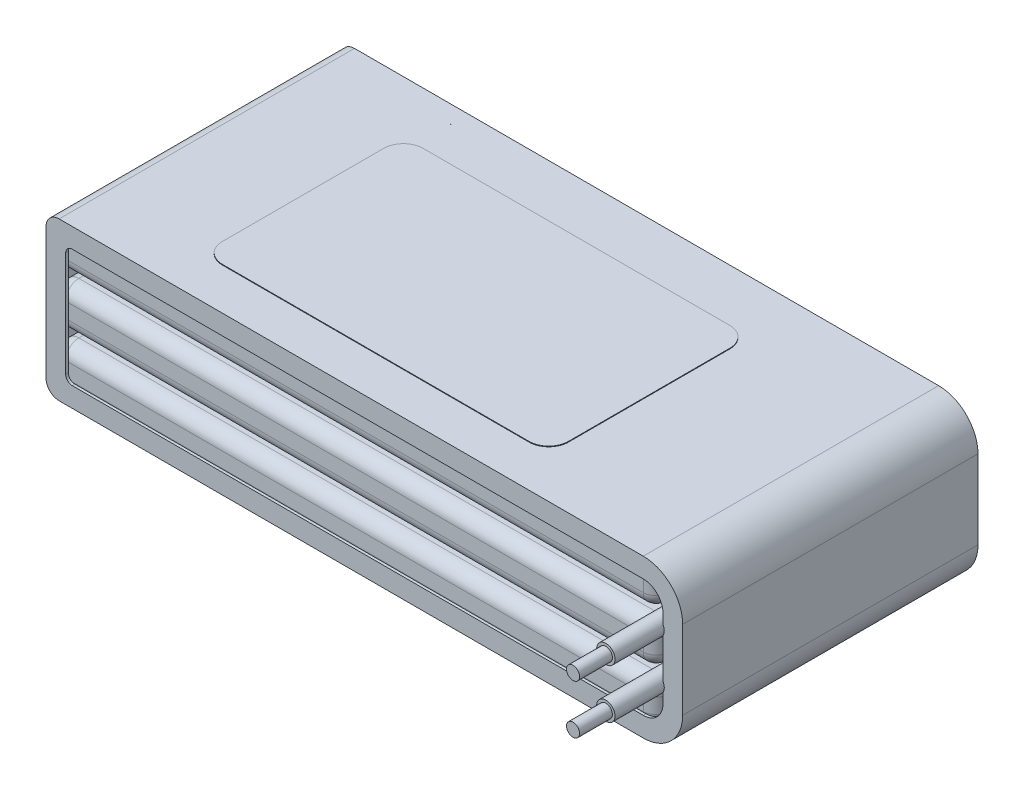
from build123d import *

# Parameters (mm, degrees)
SKETCH1_W             = 92
SKETCH1_H             = 44
BOSS_EXTRUDE1_DEPTH   = 3.15
FILLET1_R             = 2
LPATTERN2_COUNT       = 3
LPATTERN2_PITCH       = 7.85
BOSS_EXTRUDE2_DEPTH   = 22.5
BOSS_EXTRUDE5_DEPTH   = 0.4
BOSS_EXTRUDE7_DEPTH   = 0.4
FILLET2_R             = 1
SKETCH4_R             = 1.4
BOSS_EXTRUDE8_DEPTH   = 30
BOSS_EXTRUDE8_2_DEPTH = 30
SKETCH5_R             = 1
BOSS_EXTRUDE4_DEPTH   = 5
BOSS_EXTRUDE4_2_DEPTH = 5
BOSS_EXTRUDE9_DEPTH   = 0.1


with BuildPart() as part:
    # Sketch1 → Boss-Extrude1 (new, symmetric)
    with BuildSketch(Plane(origin=(0, 0, 0), x_dir=(1, 0, 0), z_dir=(0, 1, 0))):
        Rectangle(SKETCH1_W, SKETCH1_H)
    extrude(amount=BOSS_EXTRUDE1_DEPTH, both=True)

    # Fillet1
    fillet1_edges = [part.edges().sort_by_distance(p)[0] for p in [
        (46, 3.15, 0),
        (0, 3.15, -22),
        (-46, 3.15, 0),
        (0, -3.15, -22),
        (46, -3.15, 0),
        (0, -3.15, 22),
        (-46, -3.15, 0),
        (0, 3.15, 22),
        (-46, 0, -22),
        (46, 0, -22),
        (46, 0, 22),
        (-46, 0, 22),
    ]]
    fillet(fillet1_edges, radius=FILLET1_R)


with BuildPart() as lpattern2_1:
    # LPattern2: pattern copy
    add(part.part.moved(Location(Vector(0, -1, 0) * (1 * LPATTERN2_PITCH))))


with BuildPart() as lpattern2_2:
    # LPattern2: pattern copy
    add(part.part.moved(Location(Vector(0, -1, 0) * (2 * LPATTERN2_PITCH))))


with BuildPart() as body_4:
    # Sketch3 → Boss-Extrude2 (new, symmetric)
    with BuildSketch(Plane.XY):
        with BuildLine():
            Line((-46.5, 2.15), (-46.5, -17.85))
            ThreePointArc((-46.5, -17.85), (-45.914213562, -19.264213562), (-44.5, -19.85))
            Line((-44.5, -19.85), (44.5, -19.85))
            ThreePointArc((44.5, -19.85), (48.742640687, -18.092640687), (50.5, -13.85))
            Line((50.5, -13.85), (50.5, -1.85))
            ThreePointArc((50.5, -1.85), (48.742640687, 2.392640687), (44.5, 4.15))
            Line((44.5, 4.15), (-44.5, 4.15))
            ThreePointArc((-44.5, 4.15), (-45.914213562, 3.564213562), (-46.5, 2.15))
        make_face()
        with BuildLine():
            Line((-44.5, 3.65), (44.5, 3.65))
            ThreePointArc((44.5, 3.65), (48.389087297, 2.039087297), (50, -1.85))
            Line((50, -1.85), (50, -13.85))
            ThreePointArc((50, -13.85), (48.389087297, -17.739087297), (44.5, -19.35))
            Line((44.5, -19.35), (-44.5, -19.35))
            ThreePointArc((-44.5, -19.35), (-45.560660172, -18.910660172), (-46, -17.85))
            Line((-46, -17.85), (-46, 2.15))
            ThreePointArc((-46, 2.15), (-45.560660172, 3.210660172), (-44.5, 3.65))
        make_face(mode=Mode.SUBTRACT)
    extrude(amount=BOSS_EXTRUDE2_DEPTH, both=True)

    # Sketch6 → Boss-Extrude5 (add)
    with BuildSketch(Plane(origin=(0, 0, -22.5), x_dir=(-1, 0, 0), z_dir=(0, 0, -1))):
        with BuildLine():
            Line((-44.5, 4.15), (44.5, 4.15))
            ThreePointArc((44.5, 4.15), (45.914213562, 3.564213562), (46.5, 2.15))
            Line((46.5, 2.15), (46.5, -17.85))
            ThreePointArc((46.5, -17.85), (45.914213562, -19.264213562), (44.5, -19.85))
            Line((44.5, -19.85), (-44.5, -19.85))
            ThreePointArc((-44.5, -19.85), (-48.742640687, -18.092640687), (-50.5, -13.85))
            Line((-50.5, -13.85), (-50.5, -1.85))
            ThreePointArc((-50.5, -1.85), (-48.742640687, 2.392640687), (-44.5, 4.15))
        make_face()
        with BuildLine():
            Line((43.5, -16.85), (-44.5, -16.85))
            ThreePointArc((-44.5, -16.85), (-46.621320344, -15.971320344), (-47.5, -13.85))
            Line((-47.5, -13.85), (-47.5, -1.85))
            ThreePointArc((-47.5, -1.85), (-46.621320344, 0.271320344), (-44.5, 1.15))
            Line((-44.5, 1.15), (43.5, 1.15))
            Line((43.5, 1.15), (43.5, -16.85))
        make_face(mode=Mode.SUBTRACT)
    extrude(amount=-BOSS_EXTRUDE5_DEPTH)

    # Sketch7 → Boss-Extrude7 (add)
    with BuildSketch(Plane.XY.offset(22.5)):
        with BuildLine():
            Line((44.5, 4.15), (-44.5, 4.15))
            ThreePointArc((-44.5, 4.15), (-45.914213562, 3.564213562), (-46.5, 2.15))
            Line((-46.5, 2.15), (-46.5, -17.85))
            ThreePointArc((-46.5, -17.85), (-45.914213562, -19.264213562), (-44.5, -19.85))
            Line((-44.5, -19.85), (44.5, -19.85))
            ThreePointArc((44.5, -19.85), (48.742640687, -18.092640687), (50.5, -13.85))
            Line((50.5, -13.85), (50.5, -1.85))
            ThreePointArc((50.5, -1.85), (48.742640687, 2.392640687), (44.5, 4.15))
        make_face()
        with BuildLine():
            Line((44.5, 1.15), (-43.5, 1.15))
            Line((-43.5, 1.15), (-43.5, -16.85))
            Line((-43.5, -16.85), (44.5, -16.85))
            ThreePointArc((44.5, -16.85), (46.621320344, -15.971320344), (47.5, -13.85))
            Line((47.5, -13.85), (47.5, -1.85))
            ThreePointArc((47.5, -1.85), (46.621320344, 0.271320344), (44.5, 1.15))
        make_face(mode=Mode.SUBTRACT)
    extrude(amount=-BOSS_EXTRUDE7_DEPTH)

    # Fillet2
    fillet2_edges = [body_4.edges().sort_by_distance(p)[0] for p in [
        (-43.5, -16.85, 22.3),
        (-43.5, 1.15, 22.3),
        (-43.5, -16.85, -22.3),
        (-43.5, 1.15, -22.3),
    ]]
    fillet(fillet2_edges, radius=FILLET2_R)


with BuildPart() as body_5:
    # Sketch4 → Boss-Extrude8 (new body)
    with BuildSketch(Plane.XY):
        with Locations((46.3, -4.1)):
            Circle(SKETCH4_R)
    extrude(amount=BOSS_EXTRUDE8_DEPTH)


with BuildPart() as body_6:
    # Sketch4 → Boss-Extrude8 2 (new body)
    with BuildSketch(Plane.XY):
        with Locations(Location((46.3, -11.6, 0), (0, 0, 180))):
            Circle(SKETCH4_R)
    extrude(amount=BOSS_EXTRUDE8_2_DEPTH)


with BuildPart() as body_7:
    # Sketch5 → Boss-Extrude4 (new body)
    with BuildSketch(Plane.XY.offset(30)):
        with Locations((46.3, -4.1)):
            Circle(SKETCH5_R)
    extrude(amount=BOSS_EXTRUDE4_DEPTH)


with BuildPart() as body_8:
    # Sketch5 → Boss-Extrude4 2 (new body)
    with BuildSketch(Plane.XY.offset(30)):
        with Locations((46.3, -11.6)):
            Circle(SKETCH5_R)
    extrude(amount=BOSS_EXTRUDE4_2_DEPTH)


with BuildPart() as body_9:
    # Sketch8 → Boss-Extrude9 (new body)
    with BuildSketch(Plane(origin=(0, 4.15, 0), x_dir=(1, 0, 0), z_dir=(0, 1, 0))):
        with BuildLine():
            Line((-25.982985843, 14.437699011), (20.756077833, 14.437699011))
            ThreePointArc((20.756077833, 14.437699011), (22.877398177, 13.559019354), (23.756077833, 11.437699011))
            Line((23.756077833, 11.437699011), (23.756077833, -13.156785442))
            ThreePointArc((23.756077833, -13.156785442), (22.877398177, -15.278105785), (20.756077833, -16.156785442))
            Line((20.756077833, -16.156785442), (-25.982985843, -16.156785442))
            ThreePointArc((-25.982985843, -16.156785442), (-28.104306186, -15.278105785), (-28.982985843, -13.156785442))
            Line((-28.982985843, -13.156785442), (-28.982985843, 11.437699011))
            ThreePointArc((-28.982985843, 11.437699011), (-28.104306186, 13.559019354), (-25.982985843, 14.437699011))
        make_face()
    extrude(amount=BOSS_EXTRUDE9_DEPTH)


solid = Compound([part.part, lpattern2_1.part, lpattern2_2.part, body_4.part, body_5.part, body_6.part, body_7.part, body_8.part, body_9.part])
